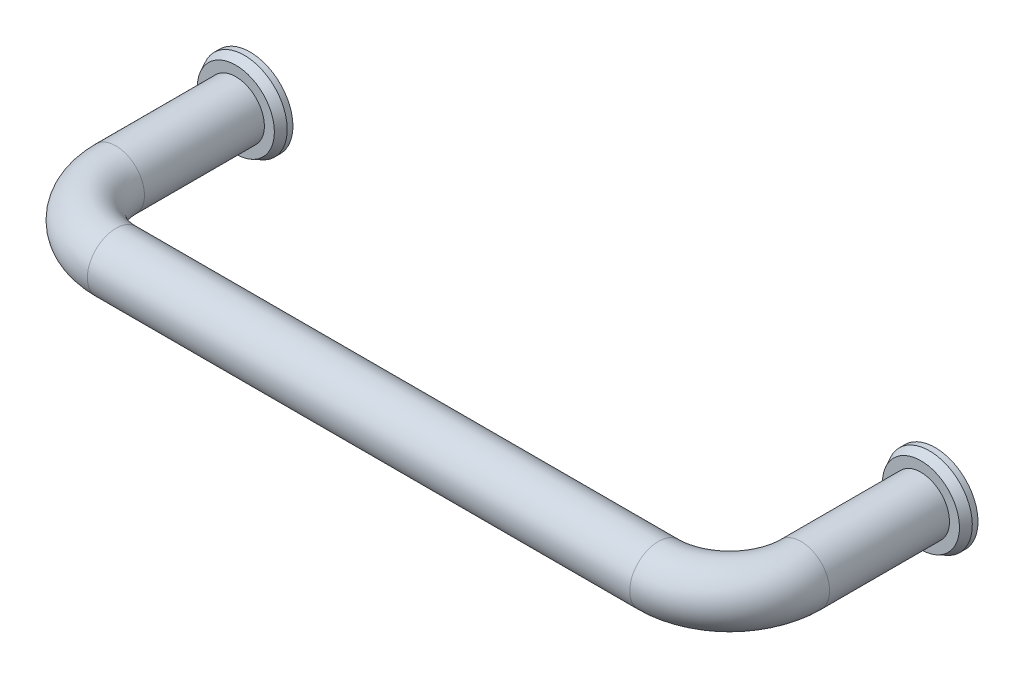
ISO-10303-21;
HEADER;
FILE_DESCRIPTION(('STEP AP214'),'2;1');
FILE_NAME('part.step','',(''),(''),'','','');
FILE_SCHEMA(('AUTOMOTIVE_DESIGN { 1 0 10303 214 1 1 1 1 }'));
ENDSEC;
DATA;
#1=APPLICATION_CONTEXT('core data for automotive mechanical design processes');
#2=APPLICATION_PROTOCOL_DEFINITION('international standard','automotive_design',2000,#1);
#3=PRODUCT_CONTEXT('',#1,'mechanical');
#4=PRODUCT('Part','Part','',(#3));
#5=PRODUCT_RELATED_PRODUCT_CATEGORY('part','',(#4));
#6=PRODUCT_DEFINITION_FORMATION('','',#4);
#7=PRODUCT_DEFINITION_CONTEXT('part definition',#1,'design');
#8=PRODUCT_DEFINITION('design','',#6,#7);
#9=PRODUCT_DEFINITION_SHAPE('','',#8);
#10=(LENGTH_UNIT() NAMED_UNIT(*) SI_UNIT(.MILLI.,.METRE.));
#11=(NAMED_UNIT(*) PLANE_ANGLE_UNIT() SI_UNIT($,.RADIAN.));
#12=(NAMED_UNIT(*) SI_UNIT($,.STERADIAN.) SOLID_ANGLE_UNIT());
#13=UNCERTAINTY_MEASURE_WITH_UNIT(LENGTH_MEASURE(1.E-05),#10,'distance_accuracy_value','');
#14=(GEOMETRIC_REPRESENTATION_CONTEXT(3) GLOBAL_UNCERTAINTY_ASSIGNED_CONTEXT((#13)) GLOBAL_UNIT_ASSIGNED_CONTEXT((#10,
#11,#12)) REPRESENTATION_CONTEXT('',''));
#15=CARTESIAN_POINT('',(0.,0.,0.));
#16=DIRECTION('',(0.,0.,1.));
#17=DIRECTION('',(1.,0.,0.));
#18=AXIS2_PLACEMENT_3D('',#15,#16,#17);
#19=CARTESIAN_POINT('',(0.,0.,0.));
#20=DIRECTION('',(0.,0.,-1.));
#21=DIRECTION('',(0.,1.,0.));
#22=AXIS2_PLACEMENT_3D('',#19,#20,#21);
#23=PLANE('',#22);
#24=CARTESIAN_POINT('',(0.,0.,0.));
#25=DIRECTION('',(0.,0.,1.));
#26=DIRECTION('',(0.,-1.,0.));
#27=AXIS2_PLACEMENT_3D('',#24,#25,#26);
#28=CIRCLE('',#27,7.5);
#29=CARTESIAN_POINT('',(0.,-7.5,0.));
#30=VERTEX_POINT('',#29);
#31=EDGE_CURVE('E56',#30,#30,#28,.T.);
#32=ORIENTED_EDGE('',*,*,#31,.F.);
#33=EDGE_LOOP('',(#32));
#34=FACE_BOUND('',#33,.T.);
#35=CARTESIAN_POINT('',(0.,0.,0.));
#36=DIRECTION('',(0.,0.,1.));
#37=DIRECTION('',(0.,-1.,0.));
#38=AXIS2_PLACEMENT_3D('',#35,#36,#37);
#39=CIRCLE('',#38,2.5);
#40=CARTESIAN_POINT('',(0.,-2.5,0.));
#41=VERTEX_POINT('',#40);
#42=EDGE_CURVE('E62',#41,#41,#39,.T.);
#43=ORIENTED_EDGE('',*,*,#42,.T.);
#44=EDGE_LOOP('',(#43));
#45=FACE_BOUND('',#44,.T.);
#46=ADVANCED_FACE('F12',(#34,#45),#23,.T.);
#47=CARTESIAN_POINT('',(0.,0.,23.5));
#48=DIRECTION('',(0.,0.,-1.));
#49=DIRECTION('',(-1.,0.,0.));
#50=AXIS2_PLACEMENT_3D('',#47,#48,#49);
#51=CYLINDRICAL_SURFACE('',#50,5.);
#52=CARTESIAN_POINT('',(0.,0.,23.5));
#53=DIRECTION('',(0.,0.,-1.));
#54=DIRECTION('',(0.,1.,0.));
#55=AXIS2_PLACEMENT_3D('',#52,#53,#54);
#56=CIRCLE('',#55,5.);
#57=CARTESIAN_POINT('',(-5.,0.,23.5));
#58=VERTEX_POINT('',#57);
#59=EDGE_CURVE('E20',#58,#58,#56,.T.);
#60=ORIENTED_EDGE('',*,*,#59,.T.);
#61=EDGE_LOOP('',(#60));
#62=FACE_BOUND('',#61,.T.);
#63=CARTESIAN_POINT('',(0.,0.,2.5));
#64=DIRECTION('',(0.,0.,-1.));
#65=DIRECTION('',(0.,-1.,0.));
#66=AXIS2_PLACEMENT_3D('',#63,#64,#65);
#67=CIRCLE('',#66,5.);
#68=CARTESIAN_POINT('',(0.,-5.,2.5));
#69=VERTEX_POINT('',#68);
#70=EDGE_CURVE('E16',#69,#69,#67,.F.);
#71=ORIENTED_EDGE('',*,*,#70,.T.);
#72=EDGE_LOOP('',(#71));
#73=FACE_BOUND('',#72,.T.);
#74=ADVANCED_FACE('F14',(#62,#73),#51,.T.);
#75=CARTESIAN_POINT('',(120.,0.,23.5));
#76=DIRECTION('',(0.,0.,-1.));
#77=DIRECTION('',(0.,-1.,0.));
#78=AXIS2_PLACEMENT_3D('',#75,#76,#77);
#79=CYLINDRICAL_SURFACE('',#78,5.);
#80=CARTESIAN_POINT('',(120.,0.,23.5));
#81=DIRECTION('',(0.,0.,1.));
#82=DIRECTION('',(0.,1.,0.));
#83=AXIS2_PLACEMENT_3D('',#80,#81,#82);
#84=CIRCLE('',#83,5.);
#85=CARTESIAN_POINT('',(125.,0.,23.5));
#86=VERTEX_POINT('',#85);
#87=EDGE_CURVE('E32',#86,#86,#84,.T.);
#88=ORIENTED_EDGE('',*,*,#87,.F.);
#89=EDGE_LOOP('',(#88));
#90=FACE_BOUND('',#89,.T.);
#91=CARTESIAN_POINT('',(120.,0.,2.49999999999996));
#92=DIRECTION('',(0.,0.,-1.));
#93=DIRECTION('',(0.,-1.,0.));
#94=AXIS2_PLACEMENT_3D('',#91,#92,#93);
#95=CIRCLE('',#94,5.);
#96=CARTESIAN_POINT('',(120.,-5.,2.49999999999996));
#97=VERTEX_POINT('',#96);
#98=EDGE_CURVE('E8',#97,#97,#95,.T.);
#99=ORIENTED_EDGE('',*,*,#98,.F.);
#100=EDGE_LOOP('',(#99));
#101=FACE_BOUND('',#100,.T.);
#102=ADVANCED_FACE('F91',(#90,#101),#79,.T.);
#103=CARTESIAN_POINT('',(12.5,0.,23.5));
#104=DIRECTION('',(0.,-1.,0.));
#105=DIRECTION('',(1.,0.,0.));
#106=AXIS2_PLACEMENT_3D('',#103,#104,#105);
#107=TOROIDAL_SURFACE('',#106,12.5,5.);
#108=CARTESIAN_POINT('',(12.5,0.,36.));
#109=DIRECTION('',(-1.,0.,0.));
#110=DIRECTION('',(0.,1.,0.));
#111=AXIS2_PLACEMENT_3D('',#108,#109,#110);
#112=CIRCLE('',#111,5.);
#113=CARTESIAN_POINT('',(12.5,0.,41.));
#114=VERTEX_POINT('',#113);
#115=EDGE_CURVE('E24',#114,#114,#112,.T.);
#116=CARTESIAN_POINT('',(12.5,0.,23.5));
#117=DIRECTION('',(0.,-1.,0.));
#118=DIRECTION('',(1.,0.,0.));
#119=AXIS2_PLACEMENT_3D('',#116,#117,#118);
#120=CIRCLE('',#119,17.5);
#121=EDGE_CURVE('',#114,#58,#120,.T.);
#122=ORIENTED_EDGE('',*,*,#115,.T.);
#123=ORIENTED_EDGE('',*,*,#59,.F.);
#124=ORIENTED_EDGE('',*,*,#121,.T.);
#125=ORIENTED_EDGE('',*,*,#121,.F.);
#126=EDGE_LOOP('',(#122,#124,#123,#125));
#127=FACE_BOUND('',#126,.T.);
#128=ADVANCED_FACE('F100',(#127),#107,.T.);
#129=CARTESIAN_POINT('',(107.5,0.,36.));
#130=DIRECTION('',(-1.,0.,0.));
#131=DIRECTION('',(0.,0.,1.));
#132=AXIS2_PLACEMENT_3D('',#129,#130,#131);
#133=CYLINDRICAL_SURFACE('',#132,5.);
#134=CARTESIAN_POINT('',(107.5,0.,36.));
#135=DIRECTION('',(-1.,0.,0.));
#136=DIRECTION('',(0.,1.,0.));
#137=AXIS2_PLACEMENT_3D('',#134,#135,#136);
#138=CIRCLE('',#137,5.);
#139=CARTESIAN_POINT('',(107.5,0.,41.));
#140=VERTEX_POINT('',#139);
#141=EDGE_CURVE('E29',#140,#140,#138,.T.);
#142=ORIENTED_EDGE('',*,*,#141,.T.);
#143=EDGE_LOOP('',(#142));
#144=FACE_BOUND('',#143,.T.);
#145=ORIENTED_EDGE('',*,*,#115,.F.);
#146=EDGE_LOOP('',(#145));
#147=FACE_BOUND('',#146,.T.);
#148=ADVANCED_FACE('F106',(#144,#147),#133,.T.);
#149=CARTESIAN_POINT('',(107.5,0.,23.5));
#150=DIRECTION('',(0.,-1.,0.));
#151=DIRECTION('',(1.,0.,0.));
#152=AXIS2_PLACEMENT_3D('',#149,#150,#151);
#153=TOROIDAL_SURFACE('',#152,12.5,5.);
#154=CARTESIAN_POINT('',(107.5,0.,23.5));
#155=DIRECTION('',(0.,-1.,0.));
#156=DIRECTION('',(1.,0.,0.));
#157=AXIS2_PLACEMENT_3D('',#154,#155,#156);
#158=CIRCLE('',#157,17.5);
#159=EDGE_CURVE('',#86,#140,#158,.T.);
#160=ORIENTED_EDGE('',*,*,#87,.T.);
#161=ORIENTED_EDGE('',*,*,#141,.F.);
#162=ORIENTED_EDGE('',*,*,#159,.T.);
#163=ORIENTED_EDGE('',*,*,#159,.F.);
#164=EDGE_LOOP('',(#160,#162,#161,#163));
#165=FACE_BOUND('',#164,.T.);
#166=ADVANCED_FACE('F102',(#165),#153,.T.);
#167=CARTESIAN_POINT('',(120.,0.,2.49999999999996));
#168=DIRECTION('',(0.,0.,-1.));
#169=DIRECTION('',(0.,-1.,0.));
#170=AXIS2_PLACEMENT_3D('',#167,#168,#169);
#171=PLANE('',#170);
#172=CARTESIAN_POINT('',(120.,0.,2.49999999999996));
#173=DIRECTION('',(0.,0.,-1.));
#174=DIRECTION('',(0.,-1.,0.));
#175=AXIS2_PLACEMENT_3D('',#172,#173,#174);
#176=CIRCLE('',#175,6.75);
#177=CARTESIAN_POINT('',(120.,-6.75,2.49999999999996));
#178=VERTEX_POINT('',#177);
#179=EDGE_CURVE('E35',#178,#178,#176,.T.);
#180=ORIENTED_EDGE('',*,*,#179,.F.);
#181=EDGE_LOOP('',(#180));
#182=FACE_BOUND('',#181,.T.);
#183=ORIENTED_EDGE('',*,*,#98,.T.);
#184=EDGE_LOOP('',(#183));
#185=FACE_BOUND('',#184,.T.);
#186=ADVANCED_FACE('F105',(#182,#185),#171,.F.);
#187=CARTESIAN_POINT('',(120.,0.,2.49999999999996));
#188=DIRECTION('',(0.,0.,-1.));
#189=DIRECTION('',(0.,-1.,0.));
#190=AXIS2_PLACEMENT_3D('',#187,#188,#189);
#191=CONICAL_SURFACE('',#190,6.75,0.463647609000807);
#192=CARTESIAN_POINT('',(120.,0.,0.999999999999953));
#193=DIRECTION('',(0.,0.,-1.));
#194=DIRECTION('',(0.,-1.,0.));
#195=AXIS2_PLACEMENT_3D('',#192,#193,#194);
#196=CIRCLE('',#195,7.5);
#197=CARTESIAN_POINT('',(120.,-7.5,0.999999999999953));
#198=VERTEX_POINT('',#197);
#199=EDGE_CURVE('E38',#198,#198,#196,.T.);
#200=ORIENTED_EDGE('',*,*,#199,.F.);
#201=EDGE_LOOP('',(#200));
#202=FACE_BOUND('',#201,.T.);
#203=ORIENTED_EDGE('',*,*,#179,.T.);
#204=EDGE_LOOP('',(#203));
#205=FACE_BOUND('',#204,.T.);
#206=ADVANCED_FACE('F146',(#202,#205),#191,.T.);
#207=CARTESIAN_POINT('',(120.,0.,0.));
#208=DIRECTION('',(0.,0.,-1.));
#209=DIRECTION('',(0.,-1.,0.));
#210=AXIS2_PLACEMENT_3D('',#207,#208,#209);
#211=CYLINDRICAL_SURFACE('',#210,7.5);
#212=CARTESIAN_POINT('',(120.,0.,0.));
#213=DIRECTION('',(0.,0.,-1.));
#214=DIRECTION('',(0.,-1.,0.));
#215=AXIS2_PLACEMENT_3D('',#212,#213,#214);
#216=CIRCLE('',#215,7.5);
#217=CARTESIAN_POINT('',(120.,-7.5,0.));
#218=VERTEX_POINT('',#217);
#219=EDGE_CURVE('E41',#218,#218,#216,.T.);
#220=ORIENTED_EDGE('',*,*,#219,.F.);
#221=EDGE_LOOP('',(#220));
#222=FACE_BOUND('',#221,.T.);
#223=ORIENTED_EDGE('',*,*,#199,.T.);
#224=EDGE_LOOP('',(#223));
#225=FACE_BOUND('',#224,.T.);
#226=ADVANCED_FACE('F143',(#222,#225),#211,.T.);
#227=CARTESIAN_POINT('',(120.,0.,0.));
#228=DIRECTION('',(0.,0.,1.));
#229=DIRECTION('',(0.,1.,0.));
#230=AXIS2_PLACEMENT_3D('',#227,#228,#229);
#231=PLANE('',#230);
#232=CARTESIAN_POINT('',(120.,0.,0.));
#233=DIRECTION('',(0.,0.,-1.));
#234=DIRECTION('',(0.,-1.,0.));
#235=AXIS2_PLACEMENT_3D('',#232,#233,#234);
#236=CIRCLE('',#235,2.5);
#237=CARTESIAN_POINT('',(120.,-2.5,0.));
#238=VERTEX_POINT('',#237);
#239=EDGE_CURVE('E47',#238,#238,#236,.T.);
#240=ORIENTED_EDGE('',*,*,#239,.F.);
#241=EDGE_LOOP('',(#240));
#242=FACE_BOUND('',#241,.T.);
#243=ORIENTED_EDGE('',*,*,#219,.T.);
#244=EDGE_LOOP('',(#243));
#245=FACE_BOUND('',#244,.T.);
#246=ADVANCED_FACE('F96',(#242,#245),#231,.F.);
#247=CARTESIAN_POINT('',(120.,0.,11.));
#248=DIRECTION('',(0.,0.,-1.));
#249=DIRECTION('',(0.,-1.,0.));
#250=AXIS2_PLACEMENT_3D('',#247,#248,#249);
#251=CYLINDRICAL_SURFACE('',#250,2.5);
#252=CARTESIAN_POINT('',(120.,0.,11.));
#253=DIRECTION('',(0.,0.,-1.));
#254=DIRECTION('',(0.,-1.,0.));
#255=AXIS2_PLACEMENT_3D('',#252,#253,#254);
#256=CIRCLE('',#255,2.5);
#257=CARTESIAN_POINT('',(120.,-2.5,11.));
#258=VERTEX_POINT('',#257);
#259=EDGE_CURVE('E44',#258,#258,#256,.T.);
#260=ORIENTED_EDGE('',*,*,#259,.F.);
#261=EDGE_LOOP('',(#260));
#262=FACE_BOUND('',#261,.T.);
#263=ORIENTED_EDGE('',*,*,#239,.T.);
#264=EDGE_LOOP('',(#263));
#265=FACE_BOUND('',#264,.T.);
#266=ADVANCED_FACE('F127',(#262,#265),#251,.F.);
#267=CARTESIAN_POINT('',(120.,0.,11.));
#268=DIRECTION('',(0.,0.,-1.));
#269=DIRECTION('',(0.,-1.,0.));
#270=AXIS2_PLACEMENT_3D('',#267,#268,#269);
#271=PLANE('',#270);
#272=ORIENTED_EDGE('',*,*,#259,.T.);
#273=EDGE_LOOP('',(#272));
#274=FACE_BOUND('',#273,.T.);
#275=ADVANCED_FACE('F125',(#274),#271,.T.);
#276=CARTESIAN_POINT('',(0.,0.,2.5));
#277=DIRECTION('',(0.,0.,-1.));
#278=DIRECTION('',(0.,-1.,0.));
#279=AXIS2_PLACEMENT_3D('',#276,#277,#278);
#280=PLANE('',#279);
#281=ORIENTED_EDGE('',*,*,#70,.F.);
#282=EDGE_LOOP('',(#281));
#283=FACE_BOUND('',#282,.T.);
#284=CARTESIAN_POINT('',(0.,0.,2.5));
#285=DIRECTION('',(0.,0.,1.));
#286=DIRECTION('',(0.,-1.,0.));
#287=AXIS2_PLACEMENT_3D('',#284,#285,#286);
#288=CIRCLE('',#287,6.75);
#289=CARTESIAN_POINT('',(0.,-6.75,2.5));
#290=VERTEX_POINT('',#289);
#291=EDGE_CURVE('E50',#290,#290,#288,.T.);
#292=ORIENTED_EDGE('',*,*,#291,.T.);
#293=EDGE_LOOP('',(#292));
#294=FACE_BOUND('',#293,.T.);
#295=ADVANCED_FACE('F122',(#283,#294),#280,.F.);
#296=CARTESIAN_POINT('',(0.,0.,2.5));
#297=DIRECTION('',(0.,0.,-1.));
#298=DIRECTION('',(0.,-1.,0.));
#299=AXIS2_PLACEMENT_3D('',#296,#297,#298);
#300=CONICAL_SURFACE('',#299,6.75,0.463647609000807);
#301=CARTESIAN_POINT('',(0.,0.,1.));
#302=DIRECTION('',(0.,0.,1.));
#303=DIRECTION('',(0.,-1.,0.));
#304=AXIS2_PLACEMENT_3D('',#301,#302,#303);
#305=CIRCLE('',#304,7.5);
#306=CARTESIAN_POINT('',(0.,-7.5,1.));
#307=VERTEX_POINT('',#306);
#308=EDGE_CURVE('E53',#307,#307,#305,.T.);
#309=ORIENTED_EDGE('',*,*,#308,.T.);
#310=EDGE_LOOP('',(#309));
#311=FACE_BOUND('',#310,.T.);
#312=ORIENTED_EDGE('',*,*,#291,.F.);
#313=EDGE_LOOP('',(#312));
#314=FACE_BOUND('',#313,.T.);
#315=ADVANCED_FACE('F81',(#311,#314),#300,.T.);
#316=CARTESIAN_POINT('',(0.,0.,0.));
#317=DIRECTION('',(0.,0.,-1.));
#318=DIRECTION('',(0.,-1.,0.));
#319=AXIS2_PLACEMENT_3D('',#316,#317,#318);
#320=CYLINDRICAL_SURFACE('',#319,7.5);
#321=ORIENTED_EDGE('',*,*,#31,.T.);
#322=EDGE_LOOP('',(#321));
#323=FACE_BOUND('',#322,.T.);
#324=ORIENTED_EDGE('',*,*,#308,.F.);
#325=EDGE_LOOP('',(#324));
#326=FACE_BOUND('',#325,.T.);
#327=ADVANCED_FACE('F70',(#323,#326),#320,.T.);
#328=CARTESIAN_POINT('',(0.,0.,11.));
#329=DIRECTION('',(0.,0.,-1.));
#330=DIRECTION('',(0.,-1.,0.));
#331=AXIS2_PLACEMENT_3D('',#328,#329,#330);
#332=CYLINDRICAL_SURFACE('',#331,2.5);
#333=CARTESIAN_POINT('',(0.,0.,11.));
#334=DIRECTION('',(0.,0.,1.));
#335=DIRECTION('',(0.,-1.,0.));
#336=AXIS2_PLACEMENT_3D('',#333,#334,#335);
#337=CIRCLE('',#336,2.5);
#338=CARTESIAN_POINT('',(0.,-2.5,11.));
#339=VERTEX_POINT('',#338);
#340=EDGE_CURVE('E59',#339,#339,#337,.T.);
#341=ORIENTED_EDGE('',*,*,#340,.T.);
#342=EDGE_LOOP('',(#341));
#343=FACE_BOUND('',#342,.T.);
#344=ORIENTED_EDGE('',*,*,#42,.F.);
#345=EDGE_LOOP('',(#344));
#346=FACE_BOUND('',#345,.T.);
#347=ADVANCED_FACE('F67',(#343,#346),#332,.F.);
#348=CARTESIAN_POINT('',(0.,0.,11.));
#349=DIRECTION('',(0.,0.,-1.));
#350=DIRECTION('',(0.,-1.,0.));
#351=AXIS2_PLACEMENT_3D('',#348,#349,#350);
#352=PLANE('',#351);
#353=ORIENTED_EDGE('',*,*,#340,.F.);
#354=EDGE_LOOP('',(#353));
#355=FACE_BOUND('',#354,.T.);
#356=ADVANCED_FACE('F69',(#355),#352,.T.);
#357=CLOSED_SHELL('',(#46,#74,#102,#128,#148,#166,#186,#206,#226,#246,#266,#275,#295,#315,#327,
#347,#356));
#358=MANIFOLD_SOLID_BREP('B1',#357);
#359=ADVANCED_BREP_SHAPE_REPRESENTATION('',(#18,#358),#14);
#360=SHAPE_DEFINITION_REPRESENTATION(#9,#359);
ENDSEC;
END-ISO-10303-21;
